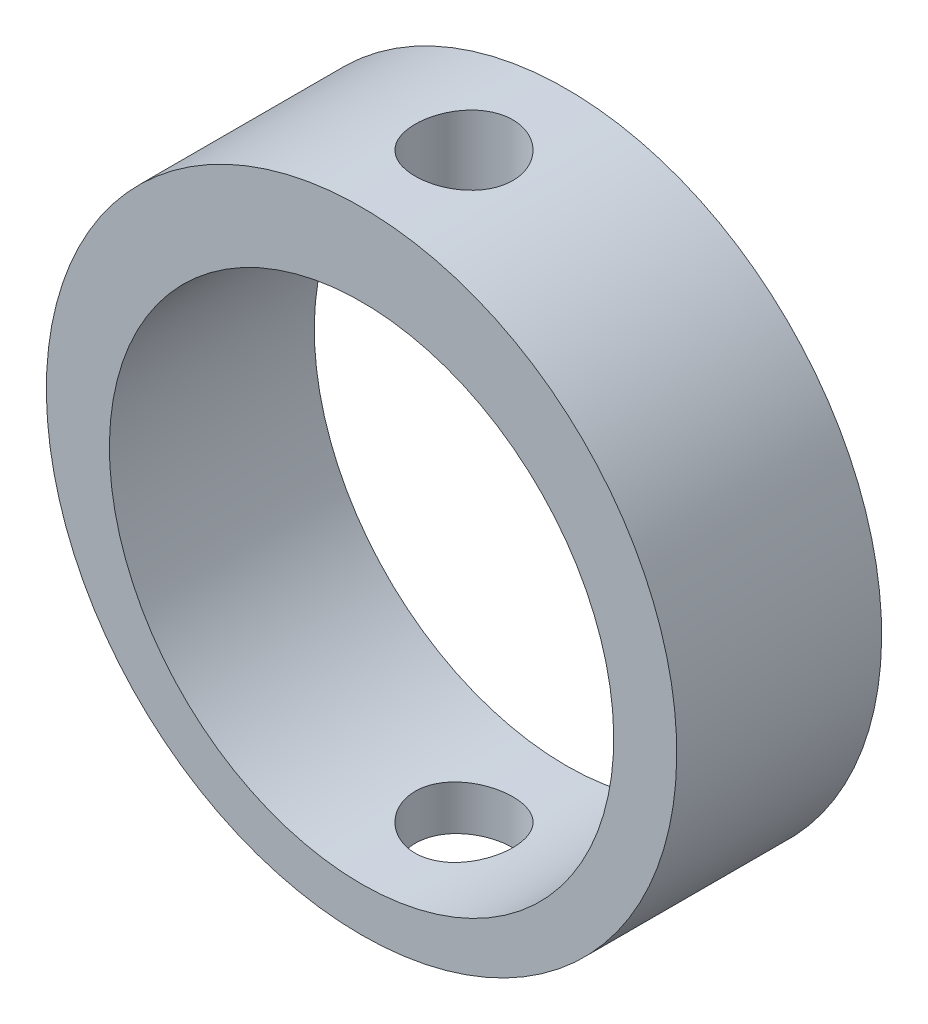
ISO-10303-21;
HEADER;
FILE_DESCRIPTION(('STEP AP214'),'2;1');
FILE_NAME('part.step','',(''),(''),'','','');
FILE_SCHEMA(('AUTOMOTIVE_DESIGN { 1 0 10303 214 1 1 1 1 }'));
ENDSEC;
DATA;
#1=APPLICATION_CONTEXT('core data for automotive mechanical design processes');
#2=APPLICATION_PROTOCOL_DEFINITION('international standard','automotive_design',2000,#1);
#3=PRODUCT_CONTEXT('',#1,'mechanical');
#4=PRODUCT('Part','Part','',(#3));
#5=PRODUCT_RELATED_PRODUCT_CATEGORY('part','',(#4));
#6=PRODUCT_DEFINITION_FORMATION('','',#4);
#7=PRODUCT_DEFINITION_CONTEXT('part definition',#1,'design');
#8=PRODUCT_DEFINITION('design','',#6,#7);
#9=PRODUCT_DEFINITION_SHAPE('','',#8);
#10=(LENGTH_UNIT() NAMED_UNIT(*) SI_UNIT(.MILLI.,.METRE.));
#11=(NAMED_UNIT(*) PLANE_ANGLE_UNIT() SI_UNIT($,.RADIAN.));
#12=(NAMED_UNIT(*) SI_UNIT($,.STERADIAN.) SOLID_ANGLE_UNIT());
#13=UNCERTAINTY_MEASURE_WITH_UNIT(LENGTH_MEASURE(1.E-05),#10,'distance_accuracy_value','');
#14=(GEOMETRIC_REPRESENTATION_CONTEXT(3) GLOBAL_UNCERTAINTY_ASSIGNED_CONTEXT((#13)) GLOBAL_UNIT_ASSIGNED_CONTEXT((#10,
#11,#12)) REPRESENTATION_CONTEXT('',''));
#15=CARTESIAN_POINT('',(0.,0.,0.));
#16=DIRECTION('',(0.,0.,1.));
#17=DIRECTION('',(1.,0.,0.));
#18=AXIS2_PLACEMENT_3D('',#15,#16,#17);
#19=CARTESIAN_POINT('',(10.,-10.,-6.5));
#20=DIRECTION('',(0.,0.,-1.));
#21=DIRECTION('',(-1.,0.,0.));
#22=AXIS2_PLACEMENT_3D('',#19,#20,#21);
#23=PLANE('',#22);
#24=CARTESIAN_POINT('',(0.,-0.6,-6.5));
#25=DIRECTION('',(0.,0.,1.));
#26=DIRECTION('',(0.,-1.,0.));
#27=AXIS2_PLACEMENT_3D('',#24,#25,#26);
#28=CIRCLE('',#27,8.);
#29=CARTESIAN_POINT('',(0.,-8.6,-6.5));
#30=VERTEX_POINT('',#29);
#31=EDGE_CURVE('E65',#30,#30,#28,.F.);
#32=ORIENTED_EDGE('',*,*,#31,.F.);
#33=EDGE_LOOP('',(#32));
#34=FACE_BOUND('',#33,.T.);
#35=CARTESIAN_POINT('',(0.,0.,-6.5));
#36=DIRECTION('',(0.,0.,1.));
#37=DIRECTION('',(0.,-1.,0.));
#38=AXIS2_PLACEMENT_3D('',#35,#36,#37);
#39=CIRCLE('',#38,10.);
#40=CARTESIAN_POINT('',(0.,-10.,-6.5));
#41=VERTEX_POINT('',#40);
#42=EDGE_CURVE('E71',#41,#41,#39,.F.);
#43=ORIENTED_EDGE('',*,*,#42,.T.);
#44=EDGE_LOOP('',(#43));
#45=FACE_BOUND('',#44,.T.);
#46=ADVANCED_FACE('F15',(#34,#45),#23,.T.);
#47=CARTESIAN_POINT('',(0.,-10.,-3.25));
#48=DIRECTION('',(0.,1.,0.));
#49=DIRECTION('',(-1.,0.,0.));
#50=AXIS2_PLACEMENT_3D('',#47,#48,#49);
#51=CYLINDRICAL_SURFACE('',#50,1.55);
#52=CARTESIAN_POINT('',(-0.20229970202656,-8.5974417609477,-1.71325837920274));
#53=CARTESIAN_POINT('',(-0.269384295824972,-8.59574486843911,-1.72208948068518));
#54=CARTESIAN_POINT('',(-0.335868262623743,-8.59321374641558,-1.7353176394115));
#55=CARTESIAN_POINT('',(-0.466534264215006,-8.58665328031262,-1.77032931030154));
#56=CARTESIAN_POINT('',(-0.530713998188,-8.58262248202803,-1.79212112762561));
#57=CARTESIAN_POINT('',(-0.655680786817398,-8.57333149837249,-1.84388386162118));
#58=CARTESIAN_POINT('',(-0.716463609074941,-8.56806981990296,-1.87386471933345));
#59=CARTESIAN_POINT('',(-0.833598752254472,-8.55666900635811,-1.94149253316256));
#60=CARTESIAN_POINT('',(-0.889946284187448,-8.55052894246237,-1.97914762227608));
#61=CARTESIAN_POINT('',(-0.997247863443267,-8.53778431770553,-2.06148289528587));
#62=CARTESIAN_POINT('',(-1.04819849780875,-8.53117946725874,-2.106167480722));
#63=CARTESIAN_POINT('',(-1.1438336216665,-8.51795284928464,-2.20180259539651));
#64=CARTESIAN_POINT('',(-1.18851796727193,-8.51133108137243,-2.25275326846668));
#65=CARTESIAN_POINT('',(-1.27085297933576,-8.49852326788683,-2.36005449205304));
#66=CARTESIAN_POINT('',(-1.30850779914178,-8.49233696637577,-2.41640182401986));
#67=CARTESIAN_POINT('',(-1.37613529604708,-8.48082668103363,-2.5335364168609));
#68=CARTESIAN_POINT('',(-1.40611602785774,-8.47550179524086,-2.59431893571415));
#69=CARTESIAN_POINT('',(-1.45787857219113,-8.46608436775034,-2.71928528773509));
#70=CARTESIAN_POINT('',(-1.47967045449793,-8.46199031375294,-2.7834648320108));
#71=CARTESIAN_POINT('',(-1.51468214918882,-8.45532028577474,-2.91413097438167));
#72=CARTESIAN_POINT('',(-1.5279104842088,-8.45274280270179,-2.98061520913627));
#73=CARTESIAN_POINT('',(-1.54556593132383,-8.44928706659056,-3.1147335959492));
#74=CARTESIAN_POINT('',(-1.54999998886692,-8.44840747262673,-3.1823667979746));
#75=CARTESIAN_POINT('',(-1.54999998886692,-8.44840747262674,-3.3176332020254));
#76=CARTESIAN_POINT('',(-1.54556593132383,-8.44928706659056,-3.3852664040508));
#77=CARTESIAN_POINT('',(-1.5279104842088,-8.45274280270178,-3.51938479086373));
#78=CARTESIAN_POINT('',(-1.51468214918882,-8.45532028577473,-3.58586902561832));
#79=CARTESIAN_POINT('',(-1.47967045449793,-8.46199031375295,-3.71653516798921));
#80=CARTESIAN_POINT('',(-1.45787857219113,-8.46608436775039,-3.78071471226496));
#81=CARTESIAN_POINT('',(-1.40611602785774,-8.47550179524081,-3.9056810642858));
#82=CARTESIAN_POINT('',(-1.37613529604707,-8.48082668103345,-3.96646358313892));
#83=CARTESIAN_POINT('',(-1.30850779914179,-8.49233696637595,-4.08359817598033));
#84=CARTESIAN_POINT('',(-1.27085297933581,-8.49852326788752,-4.13994550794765));
#85=CARTESIAN_POINT('',(-1.18851796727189,-8.51133108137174,-4.24724673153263));
#86=CARTESIAN_POINT('',(-1.14383362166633,-8.51795284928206,-4.29819740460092));
#87=CARTESIAN_POINT('',(-1.04819849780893,-8.53117946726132,-4.39383251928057));
#88=CARTESIAN_POINT('',(-0.997247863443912,-8.53778431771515,-4.43851710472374));
#89=CARTESIAN_POINT('',(-0.889946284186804,-8.55052894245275,-4.52085237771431));
#90=CARTESIAN_POINT('',(-0.833598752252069,-8.55666900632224,-4.55850746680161));
#91=CARTESIAN_POINT('',(-0.716463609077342,-8.5680698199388,-4.62613528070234));
#92=CARTESIAN_POINT('',(-0.655680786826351,-8.57333149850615,-4.65611613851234));
#93=CARTESIAN_POINT('',(-0.530713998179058,-8.58262248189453,-4.70787887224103));
#94=CARTESIAN_POINT('',(-0.466534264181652,-8.5866532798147,-4.72967068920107));
#95=CARTESIAN_POINT('',(-0.335868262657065,-8.59321374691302,-4.76468236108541));
#96=CARTESIAN_POINT('',(-0.26938429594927,-8.59574487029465,-4.77791052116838));
#97=CARTESIAN_POINT('',(-0.135266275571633,-8.59913735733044,-4.79556598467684));
#98=CARTESIAN_POINT('',(-0.0676331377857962,-8.5999999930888,-4.7999999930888));
#99=CARTESIAN_POINT('',(0.0676331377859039,-8.5999999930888,-4.7999999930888));
#100=CARTESIAN_POINT('',(0.135266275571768,-8.59913735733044,-4.79556598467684));
#101=CARTESIAN_POINT('',(0.269384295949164,-8.59574487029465,-4.77791052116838));
#102=CARTESIAN_POINT('',(0.335868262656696,-8.59321374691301,-4.76468236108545));
#103=CARTESIAN_POINT('',(0.4665342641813,-8.5866532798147,-4.72967068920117));
#104=CARTESIAN_POINT('',(0.530713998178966,-8.58262248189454,-4.70787887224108));
#105=CARTESIAN_POINT('',(0.655680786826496,-8.57333149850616,-4.6561161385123));
#106=CARTESIAN_POINT('',(0.716463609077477,-8.56806981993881,-4.62613528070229));
#107=CARTESIAN_POINT('',(0.833598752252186,-8.55666900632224,-4.55850746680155));
#108=CARTESIAN_POINT('',(0.889946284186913,-8.55052894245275,-4.52085237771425));
#109=CARTESIAN_POINT('',(0.997247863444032,-8.53778431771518,-4.43851710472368));
#110=CARTESIAN_POINT('',(1.04819849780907,-8.53117946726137,-4.39383251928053));
#111=CARTESIAN_POINT('',(1.14383362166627,-8.51795284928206,-4.29819740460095));
#112=CARTESIAN_POINT('',(1.18851796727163,-8.51133108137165,-4.24724673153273));
#113=CARTESIAN_POINT('',(1.27085297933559,-8.49852326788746,-4.13994550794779));
#114=CARTESIAN_POINT('',(1.30850779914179,-8.49233696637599,-4.0835981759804));
#115=CARTESIAN_POINT('',(1.37613529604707,-8.48082668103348,-3.96646358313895));
#116=CARTESIAN_POINT('',(1.40611602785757,-8.47550179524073,-3.90568106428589));
#117=CARTESIAN_POINT('',(1.45787857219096,-8.46608436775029,-3.78071471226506));
#118=CARTESIAN_POINT('',(1.47967045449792,-8.46199031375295,-3.71653516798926));
#119=CARTESIAN_POINT('',(1.51468214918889,-8.45532028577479,-3.5858690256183));
#120=CARTESIAN_POINT('',(1.52791048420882,-8.4527428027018,-3.5193847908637));
#121=CARTESIAN_POINT('',(1.54556593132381,-8.44928706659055,-3.38526640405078));
#122=CARTESIAN_POINT('',(1.54999998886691,-8.44840747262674,-3.31763320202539));
#123=CARTESIAN_POINT('',(1.54999998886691,-8.44840747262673,-3.18236679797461));
#124=CARTESIAN_POINT('',(1.54556593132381,-8.44928706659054,-3.11473359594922));
#125=CARTESIAN_POINT('',(1.52791048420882,-8.4527428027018,-2.98061520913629));
#126=CARTESIAN_POINT('',(1.51468214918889,-8.4553202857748,-2.91413097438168));
#127=CARTESIAN_POINT('',(1.47967045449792,-8.46199031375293,-2.78346483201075));
#128=CARTESIAN_POINT('',(1.45787857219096,-8.46608436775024,-2.71928528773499));
#129=CARTESIAN_POINT('',(1.40611602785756,-8.47550179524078,-2.59431893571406));
#130=CARTESIAN_POINT('',(1.37613529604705,-8.48082668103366,-2.53353641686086));
#131=CARTESIAN_POINT('',(1.30850779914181,-8.4923369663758,-2.41640182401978));
#132=CARTESIAN_POINT('',(1.27085297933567,-8.49852326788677,-2.3600544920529));
#133=CARTESIAN_POINT('',(1.18851796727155,-8.51133108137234,-2.25275326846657));
#134=CARTESIAN_POINT('',(1.14383362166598,-8.51795284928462,-2.20180259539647));
#135=CARTESIAN_POINT('',(1.04819849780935,-8.5311794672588,-2.10616748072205));
#136=CARTESIAN_POINT('',(0.997247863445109,-8.53778431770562,-2.06148289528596));
#137=CARTESIAN_POINT('',(0.889946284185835,-8.55052894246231,-1.97914762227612));
#138=CARTESIAN_POINT('',(0.833598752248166,-8.55666900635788,-1.94149253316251));
#139=CARTESIAN_POINT('',(0.716463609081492,-8.5680698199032,-1.87386471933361));
#140=CARTESIAN_POINT('',(0.655680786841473,-8.57333149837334,-1.84388386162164));
#141=CARTESIAN_POINT('',(0.530713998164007,-8.5826224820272,-1.79212112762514));
#142=CARTESIAN_POINT('',(0.466534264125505,-8.58665328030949,-1.77032931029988));
#143=CARTESIAN_POINT('',(0.3358683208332,-8.59321374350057,-1.73531765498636));
#144=CARTESIAN_POINT('',(0.269384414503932,-8.59574486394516,-1.72208950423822));
#145=CARTESIAN_POINT('',(0.135266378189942,-8.59913735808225,-1.70443401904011));
#146=CARTESIAN_POINT('',(0.0676331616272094,-8.60000000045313,-1.69999999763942));
#147=CARTESIAN_POINT('',(-0.0676331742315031,-8.59999999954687,-1.70000000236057));
#148=CARTESIAN_POINT('',(-0.135266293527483,-8.59913735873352,-1.70443401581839));
#149=CARTESIAN_POINT('',(-0.20229970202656,-8.5974417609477,-1.71325837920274));
#150=B_SPLINE_CURVE_WITH_KNOTS('',3,(#52,#53,#54,#55,#56,#57,#58,#59,#60,#61,#62,#63,#64,#65,
#66,#67,#68,#69,#70,#71,#72,#73,#74,#75,#76,#77,#78,#79,#80,#81,#82,#83,#84,#85,#86,#87,#88,#89,
#90,#91,#92,#93,#94,#95,#96,#97,#98,#99,#100,#101,#102,#103,#104,#105,#106,#107,#108,#109,#110,
#111,#112,#113,#114,#115,#116,#117,#118,#119,#120,#121,#122,#123,#124,#125,#126,#127,#128,#129,
#130,#131,#132,#133,#134,#135,#136,#137,#138,#139,#140,#141,#142,#143,#144,#145,#146,#147,#148,
#149),.UNSPECIFIED.,.T.,.F.,(4,2,2,2,2,2,2,2,2,2,2,2,2,2,2,2,2,2,2,2,2,2,2,2,2,2,2,2,2,2,2,2,2,
2,2,2,2,2,2,2,2,2,2,2,2,2,2,2,4),(0.,0.202904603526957,0.406006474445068,0.609356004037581,
0.812922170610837,1.01661631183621,1.22031512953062,1.42389320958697,1.62725673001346,
1.83036935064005,2.03327951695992,2.23602936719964,2.43877921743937,2.64168938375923,
2.84480200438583,3.04816552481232,3.25174360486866,3.45544242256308,3.65913656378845,
3.86270273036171,4.06605225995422,4.26915413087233,4.47205873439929,4.67480857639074,
4.87755841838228,5.08046302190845,5.28356489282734,5.48691442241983,5.69048058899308,
5.89417473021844,6.09787354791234,6.30145162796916,6.50481514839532,6.7079277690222,
6.91083793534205,7.11358778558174,7.31633763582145,7.5192478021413,7.72236042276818,
7.92572394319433,8.12930202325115,8.33300084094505,8.53669498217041,8.74026114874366,
8.94361067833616,9.14671254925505,9.3496169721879,9.55236704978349,9.7551168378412),.UNSPECIFIED.);
#151=CARTESIAN_POINT('',(-0.20229970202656,-8.5974417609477,-1.71325837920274));
#152=VERTEX_POINT('',#151);
#153=EDGE_CURVE('E41',#152,#152,#150,.T.);
#154=ORIENTED_EDGE('',*,*,#153,.F.);
#155=EDGE_LOOP('',(#154));
#156=FACE_BOUND('',#155,.T.);
#157=CARTESIAN_POINT('',(0.202305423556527,-9.9979534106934,-4.78674086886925));
#158=CARTESIAN_POINT('',(0.269378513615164,-9.99659624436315,-4.77791101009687));
#159=CARTESIAN_POINT('',(0.335858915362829,-9.99457200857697,-4.76468488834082));
#160=CARTESIAN_POINT('',(0.466520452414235,-9.98932618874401,-4.72967436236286));
#161=CARTESIAN_POINT('',(0.530700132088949,-9.9861038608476,-4.70788464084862));
#162=CARTESIAN_POINT('',(0.655666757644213,-9.97867846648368,-4.65612191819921));
#163=CARTESIAN_POINT('',(0.71645102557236,-9.97447463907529,-4.62614256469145));
#164=CARTESIAN_POINT('',(0.833588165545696,-9.96536934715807,-4.55851355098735));
#165=CARTESIAN_POINT('',(0.889938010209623,-9.96046741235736,-4.52085871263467));
#166=CARTESIAN_POINT('',(0.997243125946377,-9.95029718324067,-4.43852073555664));
#167=CARTESIAN_POINT('',(1.04819622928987,-9.9450287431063,-4.39383479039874));
#168=CARTESIAN_POINT('',(1.14383501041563,-9.93448329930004,-4.2981960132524));
#169=CARTESIAN_POINT('',(1.18852065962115,-9.9292062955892,-4.24724315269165));
#170=CARTESIAN_POINT('',(1.27085849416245,-9.91900404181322,-4.13993836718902));
#171=CARTESIAN_POINT('',(1.30851333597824,-9.91407865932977,-4.08358849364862));
#172=CARTESIAN_POINT('',(1.37614236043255,-9.9049178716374,-3.96645142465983));
#173=CARTESIAN_POINT('',(1.40612170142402,-9.90068200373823,-3.90566724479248));
#174=CARTESIAN_POINT('',(1.45788440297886,-9.8931925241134,-3.78070074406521));
#175=CARTESIAN_POINT('',(1.47967417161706,-9.88993814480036,-3.71652112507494));
#176=CARTESIAN_POINT('',(1.51468475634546,-9.88463680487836,-3.58585944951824));
#177=CARTESIAN_POINT('',(1.52791097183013,-9.88258908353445,-3.51937887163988));
#178=CARTESIAN_POINT('',(1.54556639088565,-9.87984336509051,-3.38526517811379));
#179=CARTESIAN_POINT('',(1.54999998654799,-9.87914469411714,-3.31763265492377));
#180=CARTESIAN_POINT('',(1.54999999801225,-9.87914469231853,-3.18236761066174));
#181=CARTESIAN_POINT('',(1.54556641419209,-9.87984336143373,-3.11473508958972));
#182=CARTESIAN_POINT('',(1.52791102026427,-9.88258907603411,-2.9806214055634));
#183=CARTESIAN_POINT('',(1.51468481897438,-9.88463679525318,-2.91414083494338));
#184=CARTESIAN_POINT('',(1.47967426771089,-9.88993813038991,-2.78347918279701));
#185=CARTESIAN_POINT('',(1.45788451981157,-9.89319250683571,-2.71929957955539));
#186=CARTESIAN_POINT('',(1.40612187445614,-9.90068197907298,-2.59433313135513));
#187=CARTESIAN_POINT('',(1.37614257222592,-9.90491784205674,-2.53354898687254));
#188=CARTESIAN_POINT('',(1.3085136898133,-9.91407861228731,-2.41641207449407));
#189=CARTESIAN_POINT('',(1.27085896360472,-9.91900398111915,-2.36006231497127));
#190=CARTESIAN_POINT('',(1.18852109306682,-9.92920624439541,-2.25275734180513));
#191=CARTESIAN_POINT('',(1.1438352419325,-9.93448327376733,-2.20180421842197));
#192=CARTESIAN_POINT('',(1.04819645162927,-9.94502871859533,-2.10616543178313));
#193=CARTESIAN_POINT('',(0.997243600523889,-9.95029713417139,-2.06147968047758));
#194=CARTESIAN_POINT('',(0.889938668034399,-9.96046735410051,-1.97914174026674));
#195=CARTESIAN_POINT('',(0.833588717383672,-9.96536930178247,-1.94148679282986));
#196=CARTESIAN_POINT('',(0.71645143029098,-9.97447461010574,-1.87385764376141));
#197=CARTESIAN_POINT('',(0.655667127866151,-9.97867844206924,-1.84387825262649));
#198=CARTESIAN_POINT('',(0.530700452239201,-9.9861038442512,-1.79211547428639));
#199=CARTESIAN_POINT('',(0.466520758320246,-9.9893261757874,-1.77032573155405));
#200=CARTESIAN_POINT('',(0.335858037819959,-9.99457204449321,-1.73531486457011));
#201=CARTESIAN_POINT('',(0.269376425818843,-9.99659630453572,-1.722088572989));
#202=CARTESIAN_POINT('',(0.135262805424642,-9.99930993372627,-1.70443343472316));
#203=CARTESIAN_POINT('',(0.0676314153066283,-9.9999999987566,-1.70000000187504));
#204=CARTESIAN_POINT('',(-0.0676324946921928,-10.0000000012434,-1.69999999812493));
#205=CARTESIAN_POINT('',(-0.135265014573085,-9.99930991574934,-1.70443357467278));
#206=CARTESIAN_POINT('',(-0.269378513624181,-9.99659624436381,-1.72208898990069));
#207=CARTESIAN_POINT('',(-0.335858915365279,-9.99457200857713,-1.73531511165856));
#208=CARTESIAN_POINT('',(-0.4665204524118,-9.98932618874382,-1.77032563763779));
#209=CARTESIAN_POINT('',(-0.530700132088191,-9.98610386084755,-1.79211535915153));
#210=CARTESIAN_POINT('',(-0.65566675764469,-9.97867846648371,-1.84387808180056));
#211=CARTESIAN_POINT('',(-0.716451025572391,-9.97447463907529,-1.87385743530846));
#212=CARTESIAN_POINT('',(-0.833588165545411,-9.96536934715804,-1.94148644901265));
#213=CARTESIAN_POINT('',(-0.889938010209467,-9.96046741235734,-1.9791412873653));
#214=CARTESIAN_POINT('',(-0.997243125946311,-9.95029718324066,-2.0614792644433));
#215=CARTESIAN_POINT('',(-1.04819622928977,-9.94502874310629,-2.10616520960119));
#216=CARTESIAN_POINT('',(-1.14383501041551,-9.93448329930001,-2.20180398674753));
#217=CARTESIAN_POINT('',(-1.18852065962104,-9.92920629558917,-2.25275684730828));
#218=CARTESIAN_POINT('',(-1.27085849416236,-9.9190040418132,-2.36006163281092));
#219=CARTESIAN_POINT('',(-1.30851333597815,-9.91407865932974,-2.41641150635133));
#220=CARTESIAN_POINT('',(-1.37614236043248,-9.90491787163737,-2.53354857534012));
#221=CARTESIAN_POINT('',(-1.40612170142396,-9.9006820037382,-2.59433275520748));
#222=CARTESIAN_POINT('',(-1.4578844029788,-9.89319252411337,-2.71929925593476));
#223=CARTESIAN_POINT('',(-1.47967417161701,-9.88993814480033,-2.78347887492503));
#224=CARTESIAN_POINT('',(-1.51468475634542,-9.88463680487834,-2.91414055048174));
#225=CARTESIAN_POINT('',(-1.52791097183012,-9.88258908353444,-2.9806211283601));
#226=CARTESIAN_POINT('',(-1.54556639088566,-9.87984336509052,-3.1147348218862));
#227=CARTESIAN_POINT('',(-1.54999998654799,-9.87914469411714,-3.18236734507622));
#228=CARTESIAN_POINT('',(-1.54999999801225,-9.87914469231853,-3.31763238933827));
#229=CARTESIAN_POINT('',(-1.5455664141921,-9.87984336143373,-3.3852649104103));
#230=CARTESIAN_POINT('',(-1.52791102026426,-9.8825890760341,-3.51937859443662));
#231=CARTESIAN_POINT('',(-1.51468481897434,-9.88463679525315,-3.58585916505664));
#232=CARTESIAN_POINT('',(-1.47967426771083,-9.88993813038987,-3.71652081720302));
#233=CARTESIAN_POINT('',(-1.45788451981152,-9.89319250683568,-3.78070042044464));
#234=CARTESIAN_POINT('',(-1.40612187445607,-9.90068197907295,-3.90566686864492));
#235=CARTESIAN_POINT('',(-1.37614257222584,-9.90491784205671,-3.9664510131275));
#236=CARTESIAN_POINT('',(-1.30851368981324,-9.91407861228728,-4.08358792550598));
#237=CARTESIAN_POINT('',(-1.27085896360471,-9.91900398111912,-4.13993768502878));
#238=CARTESIAN_POINT('',(-1.18852109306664,-9.92920624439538,-4.24724265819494));
#239=CARTESIAN_POINT('',(-1.14383524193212,-9.93448327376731,-4.29819578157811));
#240=CARTESIAN_POINT('',(-1.04819645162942,-9.94502871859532,-4.39383456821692));
#241=CARTESIAN_POINT('',(-0.997243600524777,-9.9502971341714,-4.43852031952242));
#242=CARTESIAN_POINT('',(-0.889938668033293,-9.96046735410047,-4.52085825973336));
#243=CARTESIAN_POINT('',(-0.833588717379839,-9.96536930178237,-4.5585132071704));
#244=CARTESIAN_POINT('',(-0.716451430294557,-9.97447461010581,-4.62614235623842));
#245=CARTESIAN_POINT('',(-0.655667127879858,-9.97867844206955,-4.65612174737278));
#246=CARTESIAN_POINT('',(-0.530700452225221,-9.98610384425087,-4.70788452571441));
#247=CARTESIAN_POINT('',(-0.466520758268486,-9.98932617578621,-4.72967426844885));
#248=CARTESIAN_POINT('',(-0.33585808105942,-9.99457204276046,-4.76468512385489));
#249=CARTESIAN_POINT('',(-0.269376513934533,-9.996596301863,-4.77791140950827));
#250=CARTESIAN_POINT('',(-0.135262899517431,-9.99930993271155,-4.79556655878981));
#251=CARTESIAN_POINT('',(-0.0676314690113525,-9.9999999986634,-4.79999999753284));
#252=CARTESIAN_POINT('',(0.0676324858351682,-10.0000000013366,-4.80000000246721));
#253=CARTESIAN_POINT('',(0.135265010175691,-9.99930991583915,-4.79556642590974));
#254=CARTESIAN_POINT('',(0.202305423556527,-9.9979534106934,-4.78674086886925));
#255=B_SPLINE_CURVE_WITH_KNOTS('',3,(#157,#158,#159,#160,#161,#162,#163,#164,#165,#166,#167,
#168,#169,#170,#171,#172,#173,#174,#175,#176,#177,#178,#179,#180,#181,#182,#183,#184,#185,#186,
#187,#188,#189,#190,#191,#192,#193,#194,#195,#196,#197,#198,#199,#200,#201,#202,#203,#204,#205,
#206,#207,#208,#209,#210,#211,#212,#213,#214,#215,#216,#217,#218,#219,#220,#221,#222,#223,#224,
#225,#226,#227,#228,#229,#230,#231,#232,#233,#234,#235,#236,#237,#238,#239,#240,#241,#242,#243,
#244,#245,#246,#247,#248,#249,#250,#251,#252,#253,#254),.UNSPECIFIED.,.T.,.F.,(4,2,2,2,2,2,2,2,
2,2,2,2,2,2,2,2,2,2,2,2,2,2,2,2,2,2,2,2,2,2,2,2,2,2,2,2,2,2,2,2,2,2,2,2,2,2,2,2,4),(0.,
0.202848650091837,0.405823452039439,0.608956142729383,0.812226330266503,1.01557785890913,
1.2189303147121,1.42220578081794,1.62534427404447,1.82832348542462,2.0311745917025,
2.23392434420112,2.43667408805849,2.63952516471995,2.84250431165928,3.04564265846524,
3.24891765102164,3.4522710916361,3.6556216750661,3.85889230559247,4.06202513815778,
4.26500000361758,4.46785227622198,4.67059871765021,4.87334853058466,5.07619718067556,
5.27917198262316,5.48230467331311,5.68557486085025,5.88892638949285,6.09227884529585,
6.2955543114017,6.49869280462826,6.70167201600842,6.90452312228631,7.10727287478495,
7.31002261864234,7.51287369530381,7.71585284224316,7.91899118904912,8.12226618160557,
8.32561962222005,8.52897020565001,8.7322408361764,8.93537366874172,9.13834853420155,
9.34120067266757,9.54394723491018,9.74669706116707),.UNSPECIFIED.);
#256=CARTESIAN_POINT('',(0.202305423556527,-9.9979534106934,-4.78674086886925));
#257=VERTEX_POINT('',#256);
#258=EDGE_CURVE('E66',#257,#257,#255,.T.);
#259=ORIENTED_EDGE('',*,*,#258,.T.);
#260=EDGE_LOOP('',(#259));
#261=FACE_BOUND('',#260,.T.);
#262=ADVANCED_FACE('F53',(#156,#261),#51,.F.);
#263=CARTESIAN_POINT('',(0.,7.23189792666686,-3.25));
#264=DIRECTION('',(0.,1.,0.));
#265=DIRECTION('',(-1.,0.,0.));
#266=AXIS2_PLACEMENT_3D('',#263,#264,#265);
#267=CYLINDRICAL_SURFACE('',#266,1.55);
#268=CARTESIAN_POINT('',(-0.202305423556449,9.9979534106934,-4.78674086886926));
#269=CARTESIAN_POINT('',(-0.269378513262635,9.99659624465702,-4.77791101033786));
#270=CARTESIAN_POINT('',(-0.335858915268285,9.99457200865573,-4.76468488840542));
#271=CARTESIAN_POINT('',(-0.466520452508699,9.98932618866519,-4.72967436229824));
#272=CARTESIAN_POINT('',(-0.530700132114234,9.98610386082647,-4.70788464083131));
#273=CARTESIAN_POINT('',(-0.655666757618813,9.97867846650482,-4.65612191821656));
#274=CARTESIAN_POINT('',(-0.716451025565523,9.97447463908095,-4.6261425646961));
#275=CARTESIAN_POINT('',(-0.833588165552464,9.96536934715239,-4.55851355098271));
#276=CARTESIAN_POINT('',(-0.889938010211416,9.96046741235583,-4.52085871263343));
#277=CARTESIAN_POINT('',(-0.997243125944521,9.95029718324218,-4.43852073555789));
#278=CARTESIAN_POINT('',(-1.04819622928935,9.9450287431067,-4.39383479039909));
#279=CARTESIAN_POINT('',(-1.14383501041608,9.93448329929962,-4.29819601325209));
#280=CARTESIAN_POINT('',(-1.18852065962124,9.92920629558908,-4.24724315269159));
#281=CARTESIAN_POINT('',(-1.27085849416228,9.91900404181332,-4.13993836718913));
#282=CARTESIAN_POINT('',(-1.30851333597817,9.91407865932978,-4.08358849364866));
#283=CARTESIAN_POINT('',(-1.37614236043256,9.90491787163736,-3.96645142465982));
#284=CARTESIAN_POINT('',(-1.40612170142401,9.90068200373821,-3.90566724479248));
#285=CARTESIAN_POINT('',(-1.45788440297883,9.8931925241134,-3.78070074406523));
#286=CARTESIAN_POINT('',(-1.47967417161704,9.88993814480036,-3.71652112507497));
#287=CARTESIAN_POINT('',(-1.51468475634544,9.88463680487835,-3.58585944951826));
#288=CARTESIAN_POINT('',(-1.52791097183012,9.88258908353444,-3.51937887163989));
#289=CARTESIAN_POINT('',(-1.54556639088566,9.87984336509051,-3.38526517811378));
#290=CARTESIAN_POINT('',(-1.54999998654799,9.87914469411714,-3.31763265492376));
#291=CARTESIAN_POINT('',(-1.54999999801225,9.87914469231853,-3.18236761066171));
#292=CARTESIAN_POINT('',(-1.5455664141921,9.87984336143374,-3.11473508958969));
#293=CARTESIAN_POINT('',(-1.52791102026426,9.88258907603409,-2.98062140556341));
#294=CARTESIAN_POINT('',(-1.51468481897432,9.88463679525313,-2.91414083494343));
#295=CARTESIAN_POINT('',(-1.47967426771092,9.88993813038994,-2.78347918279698));
#296=CARTESIAN_POINT('',(-1.45788451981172,9.89319250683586,-2.71929957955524));
#297=CARTESIAN_POINT('',(-1.40612187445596,9.90068197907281,-2.59433313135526));
#298=CARTESIAN_POINT('',(-1.3761425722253,9.90491784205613,-2.53354898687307));
#299=CARTESIAN_POINT('',(-1.30851368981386,9.9140786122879,-2.41641207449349));
#300=CARTESIAN_POINT('',(-1.27085896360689,9.91900398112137,-2.36006231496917));
#301=CARTESIAN_POINT('',(-1.18852109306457,9.92920624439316,-2.25275734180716));
#302=CARTESIAN_POINT('',(-1.14383524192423,9.93448327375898,-2.20180421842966));
#303=CARTESIAN_POINT('',(-1.04819645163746,9.94502871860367,-2.1061654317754));
#304=CARTESIAN_POINT('',(-0.997243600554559,9.95029713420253,-2.06147968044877));
#305=CARTESIAN_POINT('',(-0.889938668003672,9.96046735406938,-1.9791417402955));
#306=CARTESIAN_POINT('',(-0.833588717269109,9.96536930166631,-1.94148679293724));
#307=CARTESIAN_POINT('',(-0.716451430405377,9.97447461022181,-1.87385764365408));
#308=CARTESIAN_POINT('',(-0.655667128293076,9.97867844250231,-1.84387825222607));
#309=CARTESIAN_POINT('',(-0.530700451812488,9.98610384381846,-1.79211547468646));
#310=CARTESIAN_POINT('',(-0.466520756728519,9.98932617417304,-1.77032573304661));
#311=CARTESIAN_POINT('',(-0.335859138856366,9.99457200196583,-1.73531515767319));
#312=CARTESIAN_POINT('',(-0.269378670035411,9.99659624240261,-1.72208901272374));
#313=CARTESIAN_POINT('',(-0.13526510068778,9.99930991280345,-1.70443358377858));
#314=CARTESIAN_POINT('',(-0.0676325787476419,9.9999999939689,-1.70000000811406));
#315=CARTESIAN_POINT('',(0.067632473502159,9.9999999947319,-1.70000000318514));
#316=CARTESIAN_POINT('',(0.135265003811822,9.999309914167,-1.70443357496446));
#317=CARTESIAN_POINT('',(0.269378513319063,9.99659624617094,-1.72208898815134));
#318=CARTESIAN_POINT('',(0.335858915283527,9.9945720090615,-1.73531511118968));
#319=CARTESIAN_POINT('',(0.466520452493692,9.98932618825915,-1.77032563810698));
#320=CARTESIAN_POINT('',(0.530700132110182,9.98610386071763,-1.7921153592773));
#321=CARTESIAN_POINT('',(0.655666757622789,9.97867846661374,-1.84387808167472));
#322=CARTESIAN_POINT('',(0.716451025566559,9.97447463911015,-1.87385743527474));
#323=CARTESIAN_POINT('',(0.833588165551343,9.96536934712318,-1.94148644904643));
#324=CARTESIAN_POINT('',(0.889938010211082,9.960467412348,-1.97914128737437));
#325=CARTESIAN_POINT('',(0.997243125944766,9.95029718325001,-2.06147926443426));
#326=CARTESIAN_POINT('',(1.04819622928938,9.9450287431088,-2.10616520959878));
#327=CARTESIAN_POINT('',(1.14383501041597,9.93448329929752,-2.20180398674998));
#328=CARTESIAN_POINT('',(1.18852065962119,9.92920629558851,-2.25275684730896));
#329=CARTESIAN_POINT('',(1.27085849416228,9.91900404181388,-2.36006163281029));
#330=CARTESIAN_POINT('',(1.30851333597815,9.91407865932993,-2.41641150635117));
#331=CARTESIAN_POINT('',(1.37614236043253,9.9049178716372,-2.53354857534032));
#332=CARTESIAN_POINT('',(1.40612170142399,9.90068200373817,-2.59433275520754));
#333=CARTESIAN_POINT('',(1.45788440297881,9.89319252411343,-2.71929925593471));
#334=CARTESIAN_POINT('',(1.47967417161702,9.88993814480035,-2.78347887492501));
#335=CARTESIAN_POINT('',(1.51468475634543,9.88463680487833,-2.91414055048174));
#336=CARTESIAN_POINT('',(1.52791097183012,9.88258908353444,-2.98062112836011));
#337=CARTESIAN_POINT('',(1.54556639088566,9.87984336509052,-3.11473482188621));
#338=CARTESIAN_POINT('',(1.54999998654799,9.87914469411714,-3.18236734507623));
#339=CARTESIAN_POINT('',(1.54999999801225,9.87914469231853,-3.31763238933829));
#340=CARTESIAN_POINT('',(1.54556641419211,9.87984336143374,-3.38526491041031));
#341=CARTESIAN_POINT('',(1.52791102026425,9.88258907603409,-3.5193785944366));
#342=CARTESIAN_POINT('',(1.51468481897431,9.88463679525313,-3.58585916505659));
#343=CARTESIAN_POINT('',(1.4796742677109,9.88993813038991,-3.71652081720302));
#344=CARTESIAN_POINT('',(1.4578845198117,9.89319250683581,-3.78070042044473));
#345=CARTESIAN_POINT('',(1.40612187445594,9.90068197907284,-3.9056668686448));
#346=CARTESIAN_POINT('',(1.37614257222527,9.90491784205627,-3.96645101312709));
#347=CARTESIAN_POINT('',(1.30851368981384,9.91407861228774,-4.08358792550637));
#348=CARTESIAN_POINT('',(1.2708589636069,9.9190039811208,-4.13993768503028));
#349=CARTESIAN_POINT('',(1.1885210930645,9.92920624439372,-4.24724265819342));
#350=CARTESIAN_POINT('',(1.14383524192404,9.93448327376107,-4.29819578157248));
#351=CARTESIAN_POINT('',(1.04819645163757,9.94502871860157,-4.39383456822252));
#352=CARTESIAN_POINT('',(0.997243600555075,9.95029713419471,-4.43852031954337));
#353=CARTESIAN_POINT('',(0.88993866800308,9.96046735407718,-4.52085825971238));
#354=CARTESIAN_POINT('',(0.833588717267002,9.96536930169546,-4.55851320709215));
#355=CARTESIAN_POINT('',(0.716451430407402,9.97447461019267,-4.62614235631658));
#356=CARTESIAN_POINT('',(0.655667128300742,9.97867844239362,-4.65612174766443));
#357=CARTESIAN_POINT('',(0.530700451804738,9.98610384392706,-4.70788452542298));
#358=CARTESIAN_POINT('',(0.466520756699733,9.98932617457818,-4.72967426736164));
#359=CARTESIAN_POINT('',(0.335859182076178,9.99457199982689,-4.76468483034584));
#360=CARTESIAN_POINT('',(0.26937875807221,9.99659623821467,-4.77791096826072));
#361=CARTESIAN_POINT('',(0.13526521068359,9.99930991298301,-4.7955664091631));
#362=CARTESIAN_POINT('',(0.0676326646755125,9.99999999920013,-4.79999999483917));
#363=CARTESIAN_POINT('',(-0.067632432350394,10.0000000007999,-4.80000000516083));
#364=CARTESIAN_POINT('',(-0.135264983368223,9.99930991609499,-4.79556642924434));
#365=CARTESIAN_POINT('',(-0.202305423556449,9.9979534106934,-4.78674086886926));
#366=B_SPLINE_CURVE_WITH_KNOTS('',3,(#268,#269,#270,#271,#272,#273,#274,#275,#276,#277,#278,
#279,#280,#281,#282,#283,#284,#285,#286,#287,#288,#289,#290,#291,#292,#293,#294,#295,#296,#297,
#298,#299,#300,#301,#302,#303,#304,#305,#306,#307,#308,#309,#310,#311,#312,#313,#314,#315,#316,
#317,#318,#319,#320,#321,#322,#323,#324,#325,#326,#327,#328,#329,#330,#331,#332,#333,#334,#335,
#336,#337,#338,#339,#340,#341,#342,#343,#344,#345,#346,#347,#348,#349,#350,#351,#352,#353,#354,
#355,#356,#357,#358,#359,#360,#361,#362,#363,#364,#365),.UNSPECIFIED.,.T.,.F.,(4,2,2,2,2,2,2,2,
2,2,2,2,2,2,2,2,2,2,2,2,2,2,2,2,2,2,2,2,2,2,2,2,2,2,2,2,2,2,2,2,2,2,2,2,2,2,2,2,4),(0.,
0.202848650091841,0.405823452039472,0.608956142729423,0.812226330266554,1.01557785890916,
1.21893031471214,1.42220578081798,1.62534427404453,1.82832348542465,2.03117459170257,
2.2339243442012,2.43667408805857,2.63952516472,2.84250431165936,3.04564265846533,
3.24891765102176,3.4522710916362,3.65562167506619,3.85889230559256,4.0620251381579,
4.26500000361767,4.46784886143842,4.67059868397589,4.87334853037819,5.07619718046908,
5.27917198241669,5.48230467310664,5.68557486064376,5.88892638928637,6.09227884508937,
6.29555431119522,6.49869280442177,6.70167201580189,6.90452312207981,7.10727287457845,
7.31002261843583,7.51287369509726,7.71585284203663,7.91899118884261,8.12226618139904,
8.3256196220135,8.52897020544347,8.73224083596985,8.9353736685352,9.13834853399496,
9.34119725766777,9.54394715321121,9.74669706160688),.UNSPECIFIED.);
#367=CARTESIAN_POINT('',(-0.202305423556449,9.9979534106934,-4.78674086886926));
#368=VERTEX_POINT('',#367);
#369=EDGE_CURVE('E59',#368,#368,#366,.T.);
#370=ORIENTED_EDGE('',*,*,#369,.T.);
#371=EDGE_LOOP('',(#370));
#372=FACE_BOUND('',#371,.T.);
#373=CARTESIAN_POINT('',(0.202299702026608,7.3974417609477,-1.71325837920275));
#374=CARTESIAN_POINT('',(0.269384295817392,7.3957448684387,-1.72208948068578));
#375=CARTESIAN_POINT('',(0.335868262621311,7.39321374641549,-1.73531763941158));
#376=CARTESIAN_POINT('',(0.466534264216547,7.38665328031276,-1.77032931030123));
#377=CARTESIAN_POINT('',(0.530713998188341,7.38262248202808,-1.79212112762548));
#378=CARTESIAN_POINT('',(0.655680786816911,7.37333149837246,-1.84388386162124));
#379=CARTESIAN_POINT('',(0.716463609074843,7.36806981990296,-1.87386471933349));
#380=CARTESIAN_POINT('',(0.833598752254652,7.35666900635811,-1.94149253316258));
#381=CARTESIAN_POINT('',(0.889946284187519,7.35052894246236,-1.97914762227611));
#382=CARTESIAN_POINT('',(0.997247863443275,7.33778431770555,-2.06148289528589));
#383=CARTESIAN_POINT('',(1.04819849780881,7.33117946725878,-2.106167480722));
#384=CARTESIAN_POINT('',(1.14383362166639,7.31795284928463,-2.20180259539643));
#385=CARTESIAN_POINT('',(1.18851796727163,7.31133108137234,-2.25275326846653));
#386=CARTESIAN_POINT('',(1.27085297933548,7.29852326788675,-2.36005449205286));
#387=CARTESIAN_POINT('',(1.30850779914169,7.29233696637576,-2.41640182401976));
#388=CARTESIAN_POINT('',(1.37613529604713,7.28082668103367,-2.5335364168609));
#389=CARTESIAN_POINT('',(1.40611602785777,7.27550179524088,-2.59431893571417));
#390=CARTESIAN_POINT('',(1.45787857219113,7.26608436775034,-2.71928528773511));
#391=CARTESIAN_POINT('',(1.47967045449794,7.26199031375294,-2.78346483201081));
#392=CARTESIAN_POINT('',(1.51468214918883,7.25532028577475,-2.91413097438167));
#393=CARTESIAN_POINT('',(1.5279104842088,7.25274280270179,-2.98061520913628));
#394=CARTESIAN_POINT('',(1.54556593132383,7.24928706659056,-3.1147335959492));
#395=CARTESIAN_POINT('',(1.54999998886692,7.24840747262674,-3.1823667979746));
#396=CARTESIAN_POINT('',(1.54999998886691,7.24840747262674,-3.3176332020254));
#397=CARTESIAN_POINT('',(1.54556593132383,7.24928706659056,-3.38526640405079));
#398=CARTESIAN_POINT('',(1.5279104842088,7.25274280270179,-3.51938479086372));
#399=CARTESIAN_POINT('',(1.51468214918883,7.25532028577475,-3.58586902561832));
#400=CARTESIAN_POINT('',(1.47967045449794,7.26199031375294,-3.71653516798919));
#401=CARTESIAN_POINT('',(1.45787857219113,7.26608436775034,-3.78071471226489));
#402=CARTESIAN_POINT('',(1.40611602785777,7.27550179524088,-3.90568106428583));
#403=CARTESIAN_POINT('',(1.37613529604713,7.28082668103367,-3.9664635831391));
#404=CARTESIAN_POINT('',(1.30850779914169,7.29233696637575,-4.08359817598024));
#405=CARTESIAN_POINT('',(1.2708529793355,7.29852326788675,-4.13994550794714));
#406=CARTESIAN_POINT('',(1.18851796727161,7.31133108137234,-4.24724673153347));
#407=CARTESIAN_POINT('',(1.14383362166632,7.31795284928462,-4.29819740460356));
#408=CARTESIAN_POINT('',(1.04819849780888,7.33117946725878,-4.39383251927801));
#409=CARTESIAN_POINT('',(0.997247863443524,7.33778431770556,-4.43851710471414));
#410=CARTESIAN_POINT('',(0.889946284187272,7.35052894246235,-4.52085237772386));
#411=CARTESIAN_POINT('',(0.833598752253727,7.35666900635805,-4.5585074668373));
#412=CARTESIAN_POINT('',(0.716463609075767,7.36806981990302,-4.62613528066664));
#413=CARTESIAN_POINT('',(0.655680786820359,7.37333149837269,-4.65611613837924));
#414=CARTESIAN_POINT('',(0.530713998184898,7.38262248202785,-4.70787887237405));
#415=CARTESIAN_POINT('',(0.466534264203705,7.3866532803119,-4.72967068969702));
#416=CARTESIAN_POINT('',(0.33586826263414,7.39321374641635,-4.76468236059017));
#417=CARTESIAN_POINT('',(0.269384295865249,7.39574486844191,-4.77791051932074));
#418=CARTESIAN_POINT('',(0.13526627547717,7.39913735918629,-4.79556598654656));
#419=CARTESIAN_POINT('',(0.0676331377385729,7.4,-4.8));
#420=CARTESIAN_POINT('',(-0.0676331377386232,7.4,-4.8));
#421=CARTESIAN_POINT('',(-0.135266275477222,7.39913735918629,-4.79556598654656));
#422=CARTESIAN_POINT('',(-0.269384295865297,7.3957448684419,-4.77791051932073));
#423=CARTESIAN_POINT('',(-0.335868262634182,7.39321374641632,-4.76468236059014));
#424=CARTESIAN_POINT('',(-0.466534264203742,7.38665328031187,-4.72967068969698));
#425=CARTESIAN_POINT('',(-0.530713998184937,7.38262248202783,-4.70787887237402));
#426=CARTESIAN_POINT('',(-0.655680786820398,7.37333149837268,-4.65611613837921));
#427=CARTESIAN_POINT('',(-0.716463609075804,7.36806981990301,-4.62613528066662));
#428=CARTESIAN_POINT('',(-0.833598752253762,7.35666900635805,-4.55850746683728));
#429=CARTESIAN_POINT('',(-0.889946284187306,7.35052894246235,-4.52085237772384));
#430=CARTESIAN_POINT('',(-0.99724786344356,7.33778431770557,-4.43851710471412));
#431=CARTESIAN_POINT('',(-1.04819849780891,7.33117946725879,-4.39383251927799));
#432=CARTESIAN_POINT('',(-1.14383362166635,7.31795284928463,-4.29819740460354));
#433=CARTESIAN_POINT('',(-1.18851796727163,7.31133108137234,-4.24724673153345));
#434=CARTESIAN_POINT('',(-1.27085297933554,7.29852326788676,-4.13994550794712));
#435=CARTESIAN_POINT('',(-1.30850779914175,7.2923369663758,-4.08359817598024));
#436=CARTESIAN_POINT('',(-1.37613529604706,7.28082668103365,-3.96646358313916));
#437=CARTESIAN_POINT('',(-1.40611602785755,7.27550179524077,-3.90568106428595));
#438=CARTESIAN_POINT('',(-1.45787857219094,7.26608436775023,-3.78071471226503));
#439=CARTESIAN_POINT('',(-1.4796704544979,7.26199031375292,-3.71653516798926));
#440=CARTESIAN_POINT('',(-1.51468214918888,7.25532028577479,-3.58586902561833));
#441=CARTESIAN_POINT('',(-1.52791048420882,7.2527428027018,-3.51938479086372));
#442=CARTESIAN_POINT('',(-1.54556593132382,7.24928706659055,-3.38526640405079));
#443=CARTESIAN_POINT('',(-1.54999998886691,7.24840747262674,-3.31763320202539));
#444=CARTESIAN_POINT('',(-1.54999998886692,7.24840747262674,-3.18236679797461));
#445=CARTESIAN_POINT('',(-1.54556593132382,7.24928706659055,-3.11473359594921));
#446=CARTESIAN_POINT('',(-1.52791048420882,7.2527428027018,-2.98061520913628));
#447=CARTESIAN_POINT('',(-1.51468214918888,7.25532028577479,-2.91413097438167));
#448=CARTESIAN_POINT('',(-1.4796704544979,7.26199031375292,-2.78346483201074));
#449=CARTESIAN_POINT('',(-1.45787857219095,7.26608436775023,-2.71928528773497));
#450=CARTESIAN_POINT('',(-1.40611602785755,7.27550179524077,-2.59431893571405));
#451=CARTESIAN_POINT('',(-1.37613529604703,7.28082668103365,-2.53353641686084));
#452=CARTESIAN_POINT('',(-1.30850779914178,7.2923369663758,-2.41640182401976));
#453=CARTESIAN_POINT('',(-1.27085297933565,7.29852326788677,-2.36005449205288));
#454=CARTESIAN_POINT('',(-1.18851796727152,7.31133108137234,-2.25275326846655));
#455=CARTESIAN_POINT('',(-1.14383362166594,7.31795284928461,-2.20180259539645));
#456=CARTESIAN_POINT('',(-1.04819849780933,7.3311794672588,-2.10616748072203));
#457=CARTESIAN_POINT('',(-0.99724786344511,7.33778431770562,-2.06148289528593));
#458=CARTESIAN_POINT('',(-0.889946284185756,7.3505289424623,-1.9791476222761));
#459=CARTESIAN_POINT('',(-0.83359875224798,7.35666900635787,-1.94149253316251));
#460=CARTESIAN_POINT('',(-0.71646360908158,7.36806981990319,-1.8738647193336));
#461=CARTESIAN_POINT('',(-0.655680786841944,7.37333149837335,-1.84388386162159));
#462=CARTESIAN_POINT('',(-0.530713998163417,7.38262248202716,-1.79212112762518));
#463=CARTESIAN_POINT('',(-0.466534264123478,7.38665328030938,-1.77032931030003));
#464=CARTESIAN_POINT('',(-0.335868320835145,7.39321374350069,-1.73531765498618));
#465=CARTESIAN_POINT('',(-0.269384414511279,7.39574486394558,-1.7220895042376));
#466=CARTESIAN_POINT('',(-0.135266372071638,7.39913735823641,-1.70443401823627));
#467=CARTESIAN_POINT('',(-0.0676331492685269,7.40000000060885,-1.69999999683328));
#468=CARTESIAN_POINT('',(0.0676331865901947,7.39999999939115,-1.7000000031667));
#469=CARTESIAN_POINT('',(0.135266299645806,7.39913735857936,-1.70443401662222));
#470=CARTESIAN_POINT('',(0.202299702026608,7.3974417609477,-1.71325837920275));
#471=B_SPLINE_CURVE_WITH_KNOTS('',3,(#373,#374,#375,#376,#377,#378,#379,#380,#381,#382,#383,
#384,#385,#386,#387,#388,#389,#390,#391,#392,#393,#394,#395,#396,#397,#398,#399,#400,#401,#402,
#403,#404,#405,#406,#407,#408,#409,#410,#411,#412,#413,#414,#415,#416,#417,#418,#419,#420,#421,
#422,#423,#424,#425,#426,#427,#428,#429,#430,#431,#432,#433,#434,#435,#436,#437,#438,#439,#440,
#441,#442,#443,#444,#445,#446,#447,#448,#449,#450,#451,#452,#453,#454,#455,#456,#457,#458,#459,
#460,#461,#462,#463,#464,#465,#466,#467,#468,#469,#470),.UNSPECIFIED.,.T.,.F.,(4,2,2,2,2,2,2,2,
2,2,2,2,2,2,2,2,2,2,2,2,2,2,2,2,2,2,2,2,2,2,2,2,2,2,2,2,2,2,2,2,2,2,2,2,2,2,2,2,4),(0.,
0.202904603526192,0.406006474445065,0.609356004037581,0.812922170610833,1.01661631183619,
1.2203151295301,1.42389320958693,1.62725673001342,1.83036935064,2.03327951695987,
2.23602936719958,2.4387792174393,2.64168938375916,2.84480200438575,3.04816552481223,
3.25174360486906,3.45544242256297,3.65913656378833,3.86270273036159,4.0660522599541,
4.26915413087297,4.47205873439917,4.6748085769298,4.87755841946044,5.08046302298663,
5.28356489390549,5.486914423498,5.69048059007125,5.89417473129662,6.09787354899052,
6.30145162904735,6.50481514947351,6.70792777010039,6.91083793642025,7.11358778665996,
7.31633763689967,7.51924780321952,7.72236042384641,7.92572394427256,8.12930202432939,
8.3330008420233,8.53669498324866,8.74026114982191,8.94361067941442,9.14671255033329,
9.34961697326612,9.55236706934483,9.75511683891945),.UNSPECIFIED.);
#472=CARTESIAN_POINT('',(0.202299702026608,7.3974417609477,-1.71325837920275));
#473=VERTEX_POINT('',#472);
#474=EDGE_CURVE('E28',#473,#473,#471,.T.);
#475=ORIENTED_EDGE('',*,*,#474,.F.);
#476=EDGE_LOOP('',(#475));
#477=FACE_BOUND('',#476,.T.);
#478=ADVANCED_FACE('F49',(#372,#477),#267,.F.);
#479=CARTESIAN_POINT('',(0.,0.,-6.5));
#480=DIRECTION('',(0.,0.,1.));
#481=DIRECTION('',(0.,-1.,0.));
#482=AXIS2_PLACEMENT_3D('',#479,#480,#481);
#483=CYLINDRICAL_SURFACE('',#482,10.);
#484=ORIENTED_EDGE('',*,*,#42,.F.);
#485=EDGE_LOOP('',(#484));
#486=FACE_BOUND('',#485,.T.);
#487=ORIENTED_EDGE('',*,*,#369,.F.);
#488=EDGE_LOOP('',(#487));
#489=FACE_BOUND('',#488,.T.);
#490=ORIENTED_EDGE('',*,*,#258,.F.);
#491=EDGE_LOOP('',(#490));
#492=FACE_BOUND('',#491,.T.);
#493=CARTESIAN_POINT('',(0.,0.,0.));
#494=DIRECTION('',(0.,0.,1.));
#495=DIRECTION('',(0.,-1.,0.));
#496=AXIS2_PLACEMENT_3D('',#493,#494,#495);
#497=CIRCLE('',#496,10.);
#498=CARTESIAN_POINT('',(0.,-10.,0.));
#499=VERTEX_POINT('',#498);
#500=EDGE_CURVE('E23',#499,#499,#497,.T.);
#501=ORIENTED_EDGE('',*,*,#500,.F.);
#502=EDGE_LOOP('',(#501));
#503=FACE_BOUND('',#502,.T.);
#504=ADVANCED_FACE('F52',(#486,#489,#492,#503),#483,.T.);
#505=CARTESIAN_POINT('',(0.,-0.6,-6.5));
#506=DIRECTION('',(0.,0.,1.));
#507=DIRECTION('',(0.,-1.,0.));
#508=AXIS2_PLACEMENT_3D('',#505,#506,#507);
#509=CYLINDRICAL_SURFACE('',#508,8.);
#510=ORIENTED_EDGE('',*,*,#31,.T.);
#511=EDGE_LOOP('',(#510));
#512=FACE_BOUND('',#511,.T.);
#513=ORIENTED_EDGE('',*,*,#474,.T.);
#514=EDGE_LOOP('',(#513));
#515=FACE_BOUND('',#514,.T.);
#516=ORIENTED_EDGE('',*,*,#153,.T.);
#517=EDGE_LOOP('',(#516));
#518=FACE_BOUND('',#517,.T.);
#519=CARTESIAN_POINT('',(0.,-0.6,0.));
#520=DIRECTION('',(0.,0.,1.));
#521=DIRECTION('',(0.,-1.,0.));
#522=AXIS2_PLACEMENT_3D('',#519,#520,#521);
#523=CIRCLE('',#522,8.);
#524=CARTESIAN_POINT('',(0.,-8.6,0.));
#525=VERTEX_POINT('',#524);
#526=EDGE_CURVE('E10',#525,#525,#523,.F.);
#527=ORIENTED_EDGE('',*,*,#526,.F.);
#528=EDGE_LOOP('',(#527));
#529=FACE_BOUND('',#528,.T.);
#530=ADVANCED_FACE('F46',(#512,#515,#518,#529),#509,.F.);
#531=CARTESIAN_POINT('',(-10.,-10.,0.));
#532=DIRECTION('',(0.,0.,1.));
#533=DIRECTION('',(1.,0.,0.));
#534=AXIS2_PLACEMENT_3D('',#531,#532,#533);
#535=PLANE('',#534);
#536=ORIENTED_EDGE('',*,*,#526,.T.);
#537=EDGE_LOOP('',(#536));
#538=FACE_BOUND('',#537,.T.);
#539=ORIENTED_EDGE('',*,*,#500,.T.);
#540=EDGE_LOOP('',(#539));
#541=FACE_BOUND('',#540,.T.);
#542=ADVANCED_FACE('F17',(#538,#541),#535,.T.);
#543=CLOSED_SHELL('',(#46,#262,#478,#504,#530,#542));
#544=MANIFOLD_SOLID_BREP('B1',#543);
#545=ADVANCED_BREP_SHAPE_REPRESENTATION('',(#18,#544),#14);
#546=SHAPE_DEFINITION_REPRESENTATION(#9,#545);
ENDSEC;
END-ISO-10303-21;
